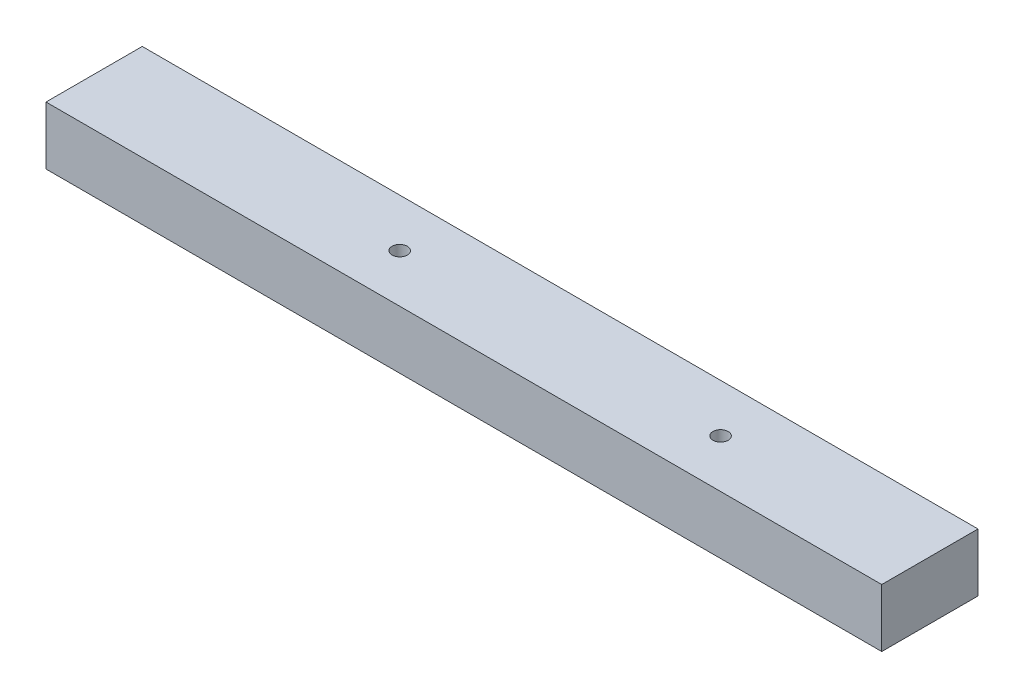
ISO-10303-21;
HEADER;
FILE_DESCRIPTION(('STEP AP214'),'2;1');
FILE_NAME('part.step','',(''),(''),'','','');
FILE_SCHEMA(('AUTOMOTIVE_DESIGN { 1 0 10303 214 1 1 1 1 }'));
ENDSEC;
DATA;
#1=APPLICATION_CONTEXT('core data for automotive mechanical design processes');
#2=APPLICATION_PROTOCOL_DEFINITION('international standard','automotive_design',2000,#1);
#3=PRODUCT_CONTEXT('',#1,'mechanical');
#4=PRODUCT('Part','Part','',(#3));
#5=PRODUCT_RELATED_PRODUCT_CATEGORY('part','',(#4));
#6=PRODUCT_DEFINITION_FORMATION('','',#4);
#7=PRODUCT_DEFINITION_CONTEXT('part definition',#1,'design');
#8=PRODUCT_DEFINITION('design','',#6,#7);
#9=PRODUCT_DEFINITION_SHAPE('','',#8);
#10=(LENGTH_UNIT() NAMED_UNIT(*) SI_UNIT(.MILLI.,.METRE.));
#11=(NAMED_UNIT(*) PLANE_ANGLE_UNIT() SI_UNIT($,.RADIAN.));
#12=(NAMED_UNIT(*) SI_UNIT($,.STERADIAN.) SOLID_ANGLE_UNIT());
#13=UNCERTAINTY_MEASURE_WITH_UNIT(LENGTH_MEASURE(1.E-05),#10,'distance_accuracy_value','');
#14=(GEOMETRIC_REPRESENTATION_CONTEXT(3) GLOBAL_UNCERTAINTY_ASSIGNED_CONTEXT((#13)) GLOBAL_UNIT_ASSIGNED_CONTEXT((#10,
#11,#12)) REPRESENTATION_CONTEXT('',''));
#15=CARTESIAN_POINT('',(0.,0.,0.));
#16=DIRECTION('',(0.,0.,1.));
#17=DIRECTION('',(1.,0.,0.));
#18=AXIS2_PLACEMENT_3D('',#15,#16,#17);
#19=CARTESIAN_POINT('',(0.,38.,0.));
#20=DIRECTION('',(0.,0.,-1.));
#21=DIRECTION('',(-1.,0.,0.));
#22=AXIS2_PLACEMENT_3D('',#19,#20,#21);
#23=PLANE('',#22);
#24=DIRECTION('',(1.,0.,0.));
#25=VECTOR('',#24,1.);
#26=CARTESIAN_POINT('',(0.,38.,0.));
#27=LINE('',#26,#25);
#28=CARTESIAN_POINT('',(610.,38.,0.));
#29=VERTEX_POINT('',#28);
#30=CARTESIAN_POINT('',(1157.,38.,0.));
#31=VERTEX_POINT('',#30);
#32=EDGE_CURVE('E41',#29,#31,#27,.T.);
#33=ORIENTED_EDGE('',*,*,#32,.F.);
#34=DIRECTION('',(0.,1.,0.));
#35=VECTOR('',#34,1.);
#36=CARTESIAN_POINT('',(610.,-0.001000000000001,0.));
#37=LINE('',#36,#35);
#38=CARTESIAN_POINT('',(610.,0.,0.));
#39=VERTEX_POINT('',#38);
#40=EDGE_CURVE('E73',#39,#29,#37,.T.);
#41=ORIENTED_EDGE('',*,*,#40,.F.);
#42=DIRECTION('',(1.,0.,0.));
#43=VECTOR('',#42,1.);
#44=CARTESIAN_POINT('',(0.,0.,0.));
#45=LINE('',#44,#43);
#46=CARTESIAN_POINT('',(1157.,0.,0.));
#47=VERTEX_POINT('',#46);
#48=EDGE_CURVE('E91',#39,#47,#45,.T.);
#49=ORIENTED_EDGE('',*,*,#48,.T.);
#50=DIRECTION('',(0.,1.,0.));
#51=VECTOR('',#50,1.);
#52=CARTESIAN_POINT('',(1157.,-0.001000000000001,0.));
#53=LINE('',#52,#51);
#54=EDGE_CURVE('E49',#47,#31,#53,.T.);
#55=ORIENTED_EDGE('',*,*,#54,.T.);
#56=EDGE_LOOP('',(#33,#41,#49,#55));
#57=FACE_BOUND('',#56,.T.);
#58=ADVANCED_FACE('F33',(#57),#23,.F.);
#59=CARTESIAN_POINT('',(0.,38.,-63.));
#60=DIRECTION('',(0.,0.,1.));
#61=DIRECTION('',(1.,0.,0.));
#62=AXIS2_PLACEMENT_3D('',#59,#60,#61);
#63=PLANE('',#62);
#64=DIRECTION('',(-1.,0.,0.));
#65=VECTOR('',#64,1.);
#66=CARTESIAN_POINT('',(0.,0.,-63.));
#67=LINE('',#66,#65);
#68=CARTESIAN_POINT('',(1157.,0.,-63.));
#69=VERTEX_POINT('',#68);
#70=CARTESIAN_POINT('',(610.,0.,-63.));
#71=VERTEX_POINT('',#70);
#72=EDGE_CURVE('E36',#69,#71,#67,.T.);
#73=ORIENTED_EDGE('',*,*,#72,.T.);
#74=DIRECTION('',(0.,1.,0.));
#75=VECTOR('',#74,1.);
#76=CARTESIAN_POINT('',(610.,-0.001000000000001,-63.));
#77=LINE('',#76,#75);
#78=CARTESIAN_POINT('',(610.,38.,-63.));
#79=VERTEX_POINT('',#78);
#80=EDGE_CURVE('E57',#71,#79,#77,.T.);
#81=ORIENTED_EDGE('',*,*,#80,.T.);
#82=DIRECTION('',(-1.,0.,0.));
#83=VECTOR('',#82,1.);
#84=CARTESIAN_POINT('',(0.,38.,-63.));
#85=LINE('',#84,#83);
#86=CARTESIAN_POINT('',(1157.,38.,-63.));
#87=VERTEX_POINT('',#86);
#88=EDGE_CURVE('E11',#87,#79,#85,.T.);
#89=ORIENTED_EDGE('',*,*,#88,.F.);
#90=DIRECTION('',(0.,1.,0.));
#91=VECTOR('',#90,1.);
#92=CARTESIAN_POINT('',(1157.,-0.001000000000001,-63.));
#93=LINE('',#92,#91);
#94=EDGE_CURVE('E105',#69,#87,#93,.T.);
#95=ORIENTED_EDGE('',*,*,#94,.F.);
#96=EDGE_LOOP('',(#73,#81,#89,#95));
#97=FACE_BOUND('',#96,.T.);
#98=ADVANCED_FACE('F123',(#97),#63,.F.);
#99=CARTESIAN_POINT('',(0.,38.,0.));
#100=DIRECTION('',(0.,-1.,0.));
#101=DIRECTION('',(0.,0.,-1.));
#102=AXIS2_PLACEMENT_3D('',#99,#100,#101);
#103=PLANE('',#102);
#104=CARTESIAN_POINT('',(810.,38.,-31.5));
#105=DIRECTION('',(0.,1.,0.));
#106=DIRECTION('',(0.,0.,-1.));
#107=AXIS2_PLACEMENT_3D('',#104,#105,#106);
#108=CIRCLE('',#107,5.00000000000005);
#109=CARTESIAN_POINT('',(810.,38.,-36.5));
#110=VERTEX_POINT('',#109);
#111=EDGE_CURVE('E97',#110,#110,#108,.T.);
#112=ORIENTED_EDGE('',*,*,#111,.F.);
#113=EDGE_LOOP('',(#112));
#114=FACE_BOUND('',#113,.T.);
#115=CARTESIAN_POINT('',(1020.,38.,-31.5000000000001));
#116=DIRECTION('',(0.,1.,0.));
#117=DIRECTION('',(0.,0.,-1.));
#118=AXIS2_PLACEMENT_3D('',#115,#116,#117);
#119=CIRCLE('',#118,5.00000000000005);
#120=CARTESIAN_POINT('',(1020.,38.,-36.5000000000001));
#121=VERTEX_POINT('',#120);
#122=EDGE_CURVE('E93',#121,#121,#119,.T.);
#123=ORIENTED_EDGE('',*,*,#122,.F.);
#124=EDGE_LOOP('',(#123));
#125=FACE_BOUND('',#124,.T.);
#126=ORIENTED_EDGE('',*,*,#88,.T.);
#127=DIRECTION('',(0.,0.,-1.));
#128=VECTOR('',#127,1.);
#129=CARTESIAN_POINT('',(610.,38.,0.));
#130=LINE('',#129,#128);
#131=EDGE_CURVE('E76',#29,#79,#130,.T.);
#132=ORIENTED_EDGE('',*,*,#131,.F.);
#133=ORIENTED_EDGE('',*,*,#32,.T.);
#134=DIRECTION('',(0.,0.,1.));
#135=VECTOR('',#134,1.);
#136=CARTESIAN_POINT('',(1157.,38.,0.));
#137=LINE('',#136,#135);
#138=EDGE_CURVE('E119',#87,#31,#137,.T.);
#139=ORIENTED_EDGE('',*,*,#138,.F.);
#140=EDGE_LOOP('',(#126,#132,#133,#139));
#141=FACE_BOUND('',#140,.T.);
#142=ADVANCED_FACE('F85',(#114,#125,#141),#103,.F.);
#143=CARTESIAN_POINT('',(0.,0.,0.));
#144=DIRECTION('',(0.,-1.,0.));
#145=DIRECTION('',(0.,0.,-1.));
#146=AXIS2_PLACEMENT_3D('',#143,#144,#145);
#147=PLANE('',#146);
#148=DIRECTION('',(0.,0.,-1.));
#149=VECTOR('',#148,1.);
#150=CARTESIAN_POINT('',(610.,0.,0.));
#151=LINE('',#150,#149);
#152=EDGE_CURVE('E77',#39,#71,#151,.T.);
#153=ORIENTED_EDGE('',*,*,#152,.T.);
#154=ORIENTED_EDGE('',*,*,#72,.F.);
#155=DIRECTION('',(0.,0.,1.));
#156=VECTOR('',#155,1.);
#157=CARTESIAN_POINT('',(1157.,0.,0.));
#158=LINE('',#157,#156);
#159=EDGE_CURVE('E117',#69,#47,#158,.T.);
#160=ORIENTED_EDGE('',*,*,#159,.T.);
#161=ORIENTED_EDGE('',*,*,#48,.F.);
#162=EDGE_LOOP('',(#153,#154,#160,#161));
#163=FACE_BOUND('',#162,.T.);
#164=CARTESIAN_POINT('',(810.,0.,-31.5));
#165=DIRECTION('',(0.,1.,0.));
#166=DIRECTION('',(0.,0.,-1.));
#167=AXIS2_PLACEMENT_3D('',#164,#165,#166);
#168=CIRCLE('',#167,5.00000000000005);
#169=CARTESIAN_POINT('',(810.,0.,-36.5));
#170=VERTEX_POINT('',#169);
#171=EDGE_CURVE('E95',#170,#170,#168,.T.);
#172=ORIENTED_EDGE('',*,*,#171,.T.);
#173=EDGE_LOOP('',(#172));
#174=FACE_BOUND('',#173,.T.);
#175=CARTESIAN_POINT('',(1020.,0.,-31.5000000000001));
#176=DIRECTION('',(0.,1.,0.));
#177=DIRECTION('',(0.,0.,-1.));
#178=AXIS2_PLACEMENT_3D('',#175,#176,#177);
#179=CIRCLE('',#178,5.00000000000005);
#180=CARTESIAN_POINT('',(1020.,0.,-36.5000000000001));
#181=VERTEX_POINT('',#180);
#182=EDGE_CURVE('E102',#181,#181,#179,.T.);
#183=ORIENTED_EDGE('',*,*,#182,.T.);
#184=EDGE_LOOP('',(#183));
#185=FACE_BOUND('',#184,.T.);
#186=ADVANCED_FACE('F129',(#163,#174,#185),#147,.T.);
#187=CARTESIAN_POINT('',(1020.,0.,-31.5000000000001));
#188=DIRECTION('',(0.,1.,0.));
#189=DIRECTION('',(0.,0.,1.));
#190=AXIS2_PLACEMENT_3D('',#187,#188,#189);
#191=CYLINDRICAL_SURFACE('',#190,5.00000000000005);
#192=ORIENTED_EDGE('',*,*,#182,.F.);
#193=EDGE_LOOP('',(#192));
#194=FACE_BOUND('',#193,.T.);
#195=ORIENTED_EDGE('',*,*,#122,.T.);
#196=EDGE_LOOP('',(#195));
#197=FACE_BOUND('',#196,.T.);
#198=ADVANCED_FACE('F134',(#194,#197),#191,.F.);
#199=CARTESIAN_POINT('',(810.,0.,-31.5));
#200=DIRECTION('',(0.,1.,0.));
#201=DIRECTION('',(0.,0.,1.));
#202=AXIS2_PLACEMENT_3D('',#199,#200,#201);
#203=CYLINDRICAL_SURFACE('',#202,5.00000000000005);
#204=ORIENTED_EDGE('',*,*,#171,.F.);
#205=EDGE_LOOP('',(#204));
#206=FACE_BOUND('',#205,.T.);
#207=ORIENTED_EDGE('',*,*,#111,.T.);
#208=EDGE_LOOP('',(#207));
#209=FACE_BOUND('',#208,.T.);
#210=ADVANCED_FACE('F139',(#206,#209),#203,.F.);
#211=CARTESIAN_POINT('',(1157.,-0.001000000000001,0.));
#212=DIRECTION('',(-1.,0.,0.));
#213=DIRECTION('',(0.,0.,1.));
#214=AXIS2_PLACEMENT_3D('',#211,#212,#213);
#215=PLANE('',#214);
#216=ORIENTED_EDGE('',*,*,#94,.T.);
#217=ORIENTED_EDGE('',*,*,#138,.T.);
#218=ORIENTED_EDGE('',*,*,#54,.F.);
#219=ORIENTED_EDGE('',*,*,#159,.F.);
#220=EDGE_LOOP('',(#216,#217,#218,#219));
#221=FACE_BOUND('',#220,.T.);
#222=ADVANCED_FACE('F121',(#221),#215,.F.);
#223=CARTESIAN_POINT('',(610.,-0.001000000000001,0.));
#224=DIRECTION('',(1.,0.,0.));
#225=DIRECTION('',(0.,0.,-1.));
#226=AXIS2_PLACEMENT_3D('',#223,#224,#225);
#227=PLANE('',#226);
#228=ORIENTED_EDGE('',*,*,#40,.T.);
#229=ORIENTED_EDGE('',*,*,#131,.T.);
#230=ORIENTED_EDGE('',*,*,#80,.F.);
#231=ORIENTED_EDGE('',*,*,#152,.F.);
#232=EDGE_LOOP('',(#228,#229,#230,#231));
#233=FACE_BOUND('',#232,.T.);
#234=ADVANCED_FACE('F75',(#233),#227,.F.);
#235=CLOSED_SHELL('',(#58,#98,#142,#186,#198,#210,#222,#234));
#236=MANIFOLD_SOLID_BREP('B2',#235);
#237=ADVANCED_BREP_SHAPE_REPRESENTATION('',(#18,#236),#14);
#238=SHAPE_DEFINITION_REPRESENTATION(#9,#237);
ENDSEC;
END-ISO-10303-21;
